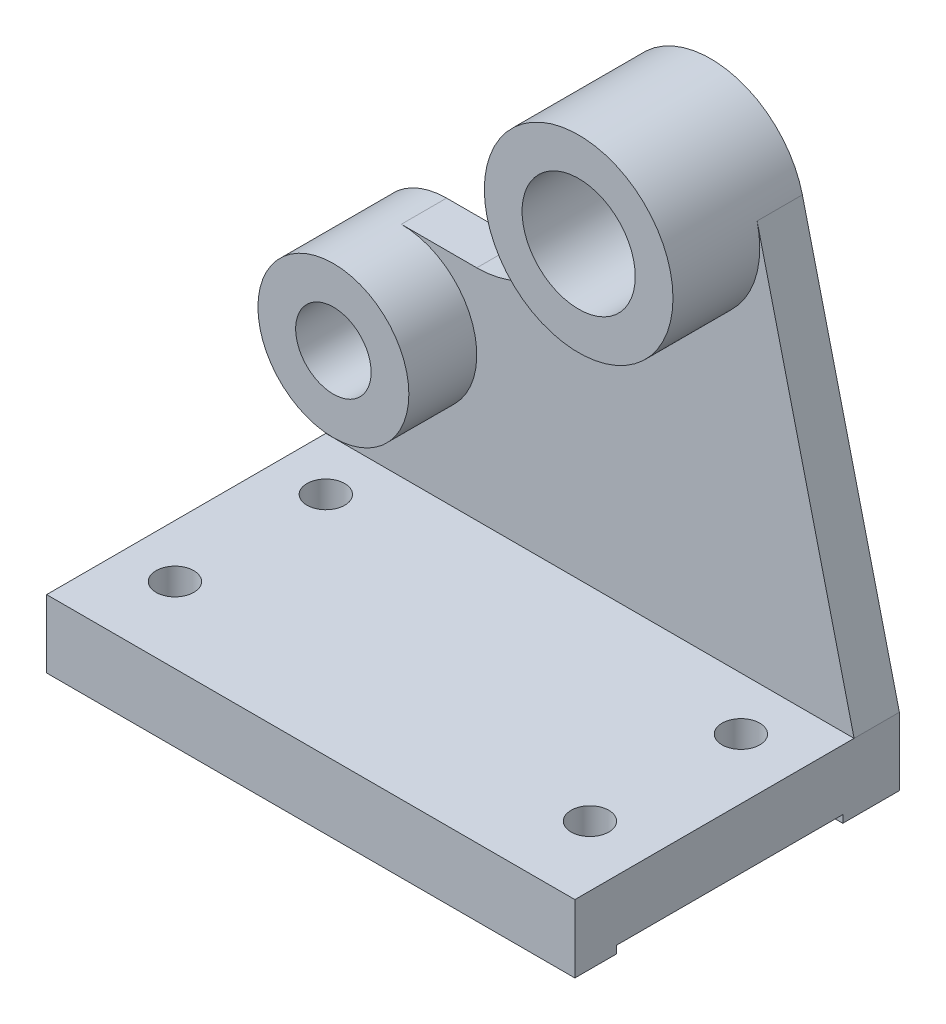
from build123d import *

# Parameters (mm, degrees)
SKETCH1_W          = 140
SKETCH1_H          = 18
EXTRUDE1_DEPTH     = 86
EXTRUDE2_DEPTH     = 12
SKETCH1_5_R        = 20
SKETCH1_5_R_2      = 10
EXTRUDE3_DEPTH     = 30
SKETCH1_6_R        = 25
SKETCH1_6_R_2      = 15
EXTRUDE4_DEPTH     = 35
SKETCH4_W          = 60
SKETCH4_H          = 2
CUT_EXTRUDE1_DEPTH = 218.818731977
SKETCH5_R          = 5
CUT_EXTRUDE2_DEPTH = 207.448540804


with BuildPart() as part:
    # Sketch1 → Extrude1 (new body)
    with BuildSketch(Plane.XY):
        with Locations((70, 9)):
            Rectangle(SKETCH1_W, SKETCH1_H)
    extrude(amount=EXTRUDE1_DEPTH)

    # Sketch1_4 → Extrude2 (add)
    with BuildSketch(Plane.XY):
        with BuildLine():
            Line((0, 56), (0, 18))
            Line((0, 18), (140, 18))
            Line((140, 18), (114.294494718, 123.897247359))
            ThreePointArc((114.294494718, 123.897247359), (114.822997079, 120.969649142), (115, 118))
            ThreePointArc((115, 118), (90, 93), (65, 118))
            Line((65, 118), (65, 101))
            ThreePointArc((65, 101), (57.67766953, 83.32233047), (40, 76))
            Line((40, 76), (20, 76))
            ThreePointArc((20, 76), (34.142135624, 70.142135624), (40, 56))
            ThreePointArc((40, 56), (20, 36), (0, 56))
        make_face()
    extrude(amount=EXTRUDE2_DEPTH)

    # Sketch1_5 → Extrude3 (add)
    with BuildSketch(Plane.XY):
        with Locations(Location((20, 56, 0), (0, 0, 180))):
            Circle(SKETCH1_5_R)
        with Locations((20, 56)):
            Circle(SKETCH1_5_R_2, mode=Mode.SUBTRACT)
    extrude(amount=EXTRUDE3_DEPTH)

    # Sketch1_6 → Extrude4 (add)
    with BuildSketch(Plane.XY):
        with Locations(Location((90, 118, 0), (0, 0, 180))):
            Circle(SKETCH1_6_R)
        with Locations((90, 118)):
            Circle(SKETCH1_6_R_2, mode=Mode.SUBTRACT)
    extrude(amount=EXTRUDE4_DEPTH)

    # Sketch4 → Cut-Extrude1 (cut, through all)
    with BuildSketch(Plane(origin=(140, 0, 0), x_dir=(0, 0, -1), z_dir=(1, 0, 0))):
        with Locations((-45, 1)):
            Rectangle(SKETCH4_W, SKETCH4_H)
    extrude(amount=-CUT_EXTRUDE1_DEPTH, mode=Mode.SUBTRACT)

    # Sketch5 → Cut-Extrude2 (cut, through all)
    with BuildSketch(Plane(origin=(0, 18, 0), x_dir=(1, 0, 0), z_dir=(0, 1, 0))):
        with Locations(Location((124, -66, 0), (0, 0, 270))):
            Circle(SKETCH5_R)
        with Locations(Location((14, -66, 0), (0, 0, 270))):
            Circle(SKETCH5_R)
        with Locations(Location((14, -26, 0), (0, 0, 270))):
            Circle(SKETCH5_R)
        with Locations(Location((124, -26, 0), (0, 0, 270))):
            Circle(SKETCH5_R)
    extrude(amount=-CUT_EXTRUDE2_DEPTH, mode=Mode.SUBTRACT)


solid = part.part
